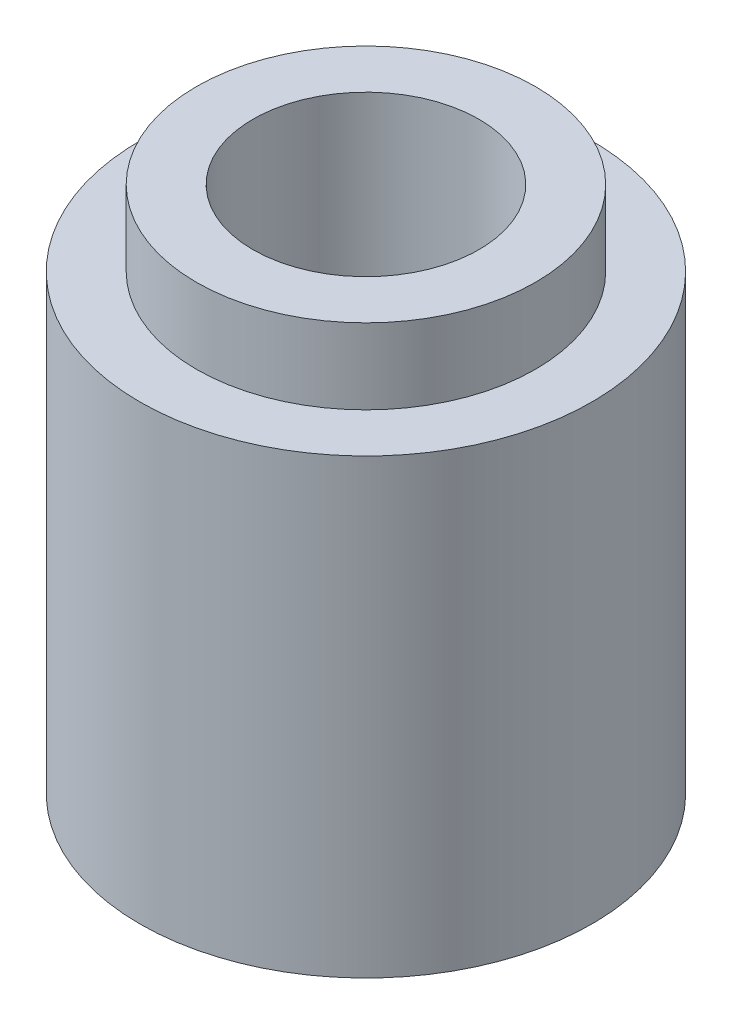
ISO-10303-21;
HEADER;
FILE_DESCRIPTION(('STEP AP214'),'2;1');
FILE_NAME('part.step','',(''),(''),'','','');
FILE_SCHEMA(('AUTOMOTIVE_DESIGN { 1 0 10303 214 1 1 1 1 }'));
ENDSEC;
DATA;
#1=APPLICATION_CONTEXT('core data for automotive mechanical design processes');
#2=APPLICATION_PROTOCOL_DEFINITION('international standard','automotive_design',2000,#1);
#3=PRODUCT_CONTEXT('',#1,'mechanical');
#4=PRODUCT('Part','Part','',(#3));
#5=PRODUCT_RELATED_PRODUCT_CATEGORY('part','',(#4));
#6=PRODUCT_DEFINITION_FORMATION('','',#4);
#7=PRODUCT_DEFINITION_CONTEXT('part definition',#1,'design');
#8=PRODUCT_DEFINITION('design','',#6,#7);
#9=PRODUCT_DEFINITION_SHAPE('','',#8);
#10=(LENGTH_UNIT() NAMED_UNIT(*) SI_UNIT(.MILLI.,.METRE.));
#11=(NAMED_UNIT(*) PLANE_ANGLE_UNIT() SI_UNIT($,.RADIAN.));
#12=(NAMED_UNIT(*) SI_UNIT($,.STERADIAN.) SOLID_ANGLE_UNIT());
#13=UNCERTAINTY_MEASURE_WITH_UNIT(LENGTH_MEASURE(1.E-05),#10,'distance_accuracy_value','');
#14=(GEOMETRIC_REPRESENTATION_CONTEXT(3) GLOBAL_UNCERTAINTY_ASSIGNED_CONTEXT((#13)) GLOBAL_UNIT_ASSIGNED_CONTEXT((#10,
#11,#12)) REPRESENTATION_CONTEXT('',''));
#15=CARTESIAN_POINT('',(0.,0.,0.));
#16=DIRECTION('',(0.,0.,1.));
#17=DIRECTION('',(1.,0.,0.));
#18=AXIS2_PLACEMENT_3D('',#15,#16,#17);
#19=CARTESIAN_POINT('',(0.,6.,0.));
#20=DIRECTION('',(0.,1.,0.));
#21=DIRECTION('',(0.,0.,1.));
#22=AXIS2_PLACEMENT_3D('',#19,#20,#21);
#23=PLANE('',#22);
#24=CARTESIAN_POINT('',(0.,6.,0.));
#25=DIRECTION('',(0.,1.,0.));
#26=DIRECTION('',(0.,0.,1.));
#27=AXIS2_PLACEMENT_3D('',#24,#25,#26);
#28=CIRCLE('',#27,3.);
#29=CARTESIAN_POINT('',(0.,6.,3.));
#30=VERTEX_POINT('',#29);
#31=EDGE_CURVE('E10',#30,#30,#28,.T.);
#32=ORIENTED_EDGE('',*,*,#31,.T.);
#33=EDGE_LOOP('',(#32));
#34=FACE_BOUND('',#33,.T.);
#35=CARTESIAN_POINT('',(0.,6.,0.));
#36=DIRECTION('',(0.,1.,0.));
#37=DIRECTION('',(0.,0.,1.));
#38=AXIS2_PLACEMENT_3D('',#35,#36,#37);
#39=CIRCLE('',#38,2.25);
#40=CARTESIAN_POINT('',(0.,6.,2.25));
#41=VERTEX_POINT('',#40);
#42=EDGE_CURVE('E42',#41,#41,#39,.T.);
#43=ORIENTED_EDGE('',*,*,#42,.F.);
#44=EDGE_LOOP('',(#43));
#45=FACE_BOUND('',#44,.T.);
#46=ADVANCED_FACE('F29',(#34,#45),#23,.T.);
#47=CARTESIAN_POINT('',(0.,6.,0.));
#48=DIRECTION('',(0.,-1.,0.));
#49=DIRECTION('',(0.,0.,-1.));
#50=AXIS2_PLACEMENT_3D('',#47,#48,#49);
#51=CYLINDRICAL_SURFACE('',#50,3.);
#52=ORIENTED_EDGE('',*,*,#31,.F.);
#53=EDGE_LOOP('',(#52));
#54=FACE_BOUND('',#53,.T.);
#55=CARTESIAN_POINT('',(0.,0.,0.));
#56=DIRECTION('',(0.,1.,0.));
#57=DIRECTION('',(0.,0.,1.));
#58=AXIS2_PLACEMENT_3D('',#55,#56,#57);
#59=CIRCLE('',#58,3.);
#60=CARTESIAN_POINT('',(0.,0.,3.));
#61=VERTEX_POINT('',#60);
#62=EDGE_CURVE('E33',#61,#61,#59,.T.);
#63=ORIENTED_EDGE('',*,*,#62,.T.);
#64=EDGE_LOOP('',(#63));
#65=FACE_BOUND('',#64,.T.);
#66=ADVANCED_FACE('F31',(#54,#65),#51,.T.);
#67=CARTESIAN_POINT('',(0.,0.,0.));
#68=DIRECTION('',(0.,1.,0.));
#69=DIRECTION('',(0.,0.,1.));
#70=AXIS2_PLACEMENT_3D('',#67,#68,#69);
#71=PLANE('',#70);
#72=CARTESIAN_POINT('',(0.,0.,0.));
#73=DIRECTION('',(0.,-1.,0.));
#74=DIRECTION('',(0.,0.,-1.));
#75=AXIS2_PLACEMENT_3D('',#72,#73,#74);
#76=CIRCLE('',#75,1.5);
#77=CARTESIAN_POINT('',(0.,0.,-1.5));
#78=VERTEX_POINT('',#77);
#79=EDGE_CURVE('E50',#78,#78,#76,.T.);
#80=ORIENTED_EDGE('',*,*,#79,.F.);
#81=EDGE_LOOP('',(#80));
#82=FACE_BOUND('',#81,.T.);
#83=ORIENTED_EDGE('',*,*,#62,.F.);
#84=EDGE_LOOP('',(#83));
#85=FACE_BOUND('',#84,.T.);
#86=ADVANCED_FACE('F57',(#82,#85),#71,.F.);
#87=CARTESIAN_POINT('',(0.,7.,0.));
#88=DIRECTION('',(0.,-1.,0.));
#89=DIRECTION('',(0.,0.,-1.));
#90=AXIS2_PLACEMENT_3D('',#87,#88,#89);
#91=CYLINDRICAL_SURFACE('',#90,2.25);
#92=CARTESIAN_POINT('',(0.,7.,0.));
#93=DIRECTION('',(0.,1.,0.));
#94=DIRECTION('',(0.,0.,1.));
#95=AXIS2_PLACEMENT_3D('',#92,#93,#94);
#96=CIRCLE('',#95,2.25);
#97=CARTESIAN_POINT('',(0.,7.,2.25));
#98=VERTEX_POINT('',#97);
#99=EDGE_CURVE('E40',#98,#98,#96,.T.);
#100=ORIENTED_EDGE('',*,*,#99,.F.);
#101=EDGE_LOOP('',(#100));
#102=FACE_BOUND('',#101,.T.);
#103=ORIENTED_EDGE('',*,*,#42,.T.);
#104=EDGE_LOOP('',(#103));
#105=FACE_BOUND('',#104,.T.);
#106=ADVANCED_FACE('F60',(#102,#105),#91,.T.);
#107=CARTESIAN_POINT('',(0.,7.,0.));
#108=DIRECTION('',(0.,1.,0.));
#109=DIRECTION('',(0.,0.,1.));
#110=AXIS2_PLACEMENT_3D('',#107,#108,#109);
#111=PLANE('',#110);
#112=CARTESIAN_POINT('',(0.,7.,0.));
#113=DIRECTION('',(0.,1.,0.));
#114=DIRECTION('',(0.,0.,1.));
#115=AXIS2_PLACEMENT_3D('',#112,#113,#114);
#116=CIRCLE('',#115,1.5);
#117=CARTESIAN_POINT('',(0.,7.,1.5));
#118=VERTEX_POINT('',#117);
#119=EDGE_CURVE('E45',#118,#118,#116,.F.);
#120=ORIENTED_EDGE('',*,*,#119,.T.);
#121=EDGE_LOOP('',(#120));
#122=FACE_BOUND('',#121,.T.);
#123=ORIENTED_EDGE('',*,*,#99,.T.);
#124=EDGE_LOOP('',(#123));
#125=FACE_BOUND('',#124,.T.);
#126=ADVANCED_FACE('F75',(#122,#125),#111,.T.);
#127=CARTESIAN_POINT('',(0.,11.2426406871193,0.));
#128=DIRECTION('',(0.,-1.,0.));
#129=DIRECTION('',(0.,0.,-1.));
#130=AXIS2_PLACEMENT_3D('',#127,#128,#129);
#131=CYLINDRICAL_SURFACE('',#130,1.5);
#132=ORIENTED_EDGE('',*,*,#79,.T.);
#133=EDGE_LOOP('',(#132));
#134=FACE_BOUND('',#133,.T.);
#135=ORIENTED_EDGE('',*,*,#119,.F.);
#136=EDGE_LOOP('',(#135));
#137=FACE_BOUND('',#136,.T.);
#138=ADVANCED_FACE('F54',(#134,#137),#131,.F.);
#139=CLOSED_SHELL('',(#46,#66,#86,#106,#126,#138));
#140=MANIFOLD_SOLID_BREP('B2',#139);
#141=ADVANCED_BREP_SHAPE_REPRESENTATION('',(#18,#140),#14);
#142=SHAPE_DEFINITION_REPRESENTATION(#9,#141);
ENDSEC;
END-ISO-10303-21;
